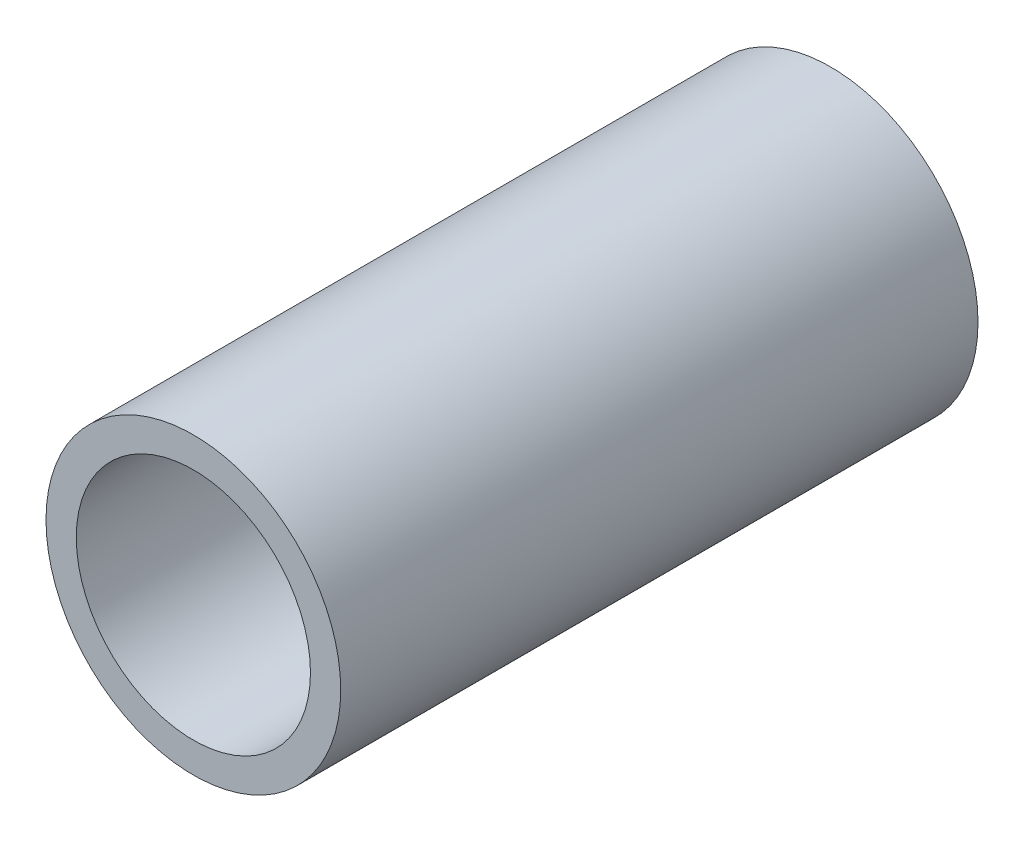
from build123d import *

# Parameters (mm, degrees)
ESQUISSE1_R        = 9.25
ESQUISSE1_R_2      = 7.35
BOSS_EXTRU_1_DEPTH = 40


with BuildPart() as part:
    # Esquisse1 → Boss.-Extru.1 (new body)
    with BuildSketch(Plane.XY):
        Circle(ESQUISSE1_R)
        Circle(ESQUISSE1_R_2, mode=Mode.SUBTRACT)
    extrude(amount=BOSS_EXTRU_1_DEPTH)


solid = part.part
